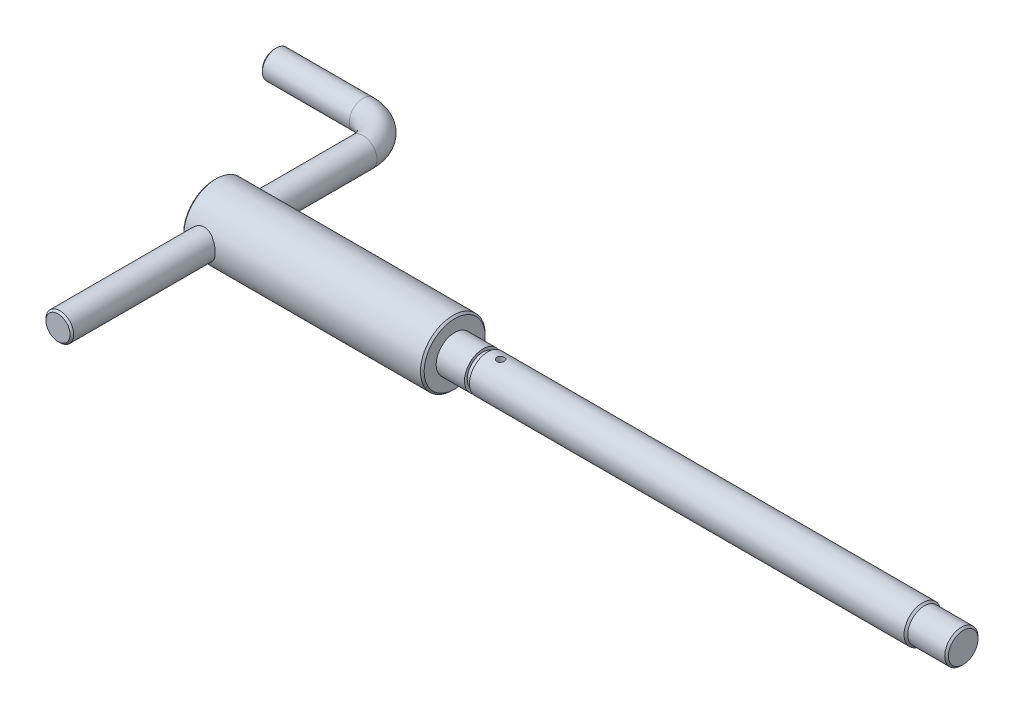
ISO-10303-21;
HEADER;
FILE_DESCRIPTION(('STEP AP214'),'2;1');
FILE_NAME('part.step','',(''),(''),'','','');
FILE_SCHEMA(('AUTOMOTIVE_DESIGN { 1 0 10303 214 1 1 1 1 }'));
ENDSEC;
DATA;
#1=APPLICATION_CONTEXT('core data for automotive mechanical design processes');
#2=APPLICATION_PROTOCOL_DEFINITION('international standard','automotive_design',2000,#1);
#3=PRODUCT_CONTEXT('',#1,'mechanical');
#4=PRODUCT('Part','Part','',(#3));
#5=PRODUCT_RELATED_PRODUCT_CATEGORY('part','',(#4));
#6=PRODUCT_DEFINITION_FORMATION('','',#4);
#7=PRODUCT_DEFINITION_CONTEXT('part definition',#1,'design');
#8=PRODUCT_DEFINITION('design','',#6,#7);
#9=PRODUCT_DEFINITION_SHAPE('','',#8);
#10=(LENGTH_UNIT() NAMED_UNIT(*) SI_UNIT(.MILLI.,.METRE.));
#11=(NAMED_UNIT(*) PLANE_ANGLE_UNIT() SI_UNIT($,.RADIAN.));
#12=(NAMED_UNIT(*) SI_UNIT($,.STERADIAN.) SOLID_ANGLE_UNIT());
#13=UNCERTAINTY_MEASURE_WITH_UNIT(LENGTH_MEASURE(1.E-05),#10,'distance_accuracy_value','');
#14=(GEOMETRIC_REPRESENTATION_CONTEXT(3) GLOBAL_UNCERTAINTY_ASSIGNED_CONTEXT((#13)) GLOBAL_UNIT_ASSIGNED_CONTEXT((#10,
#11,#12)) REPRESENTATION_CONTEXT('',''));
#15=CARTESIAN_POINT('',(0.,0.,0.));
#16=DIRECTION('',(0.,0.,1.));
#17=DIRECTION('',(1.,0.,0.));
#18=AXIS2_PLACEMENT_3D('',#15,#16,#17);
#19=CARTESIAN_POINT('',(0.,0.,0.));
#20=DIRECTION('',(-1.,0.,0.));
#21=DIRECTION('',(0.,0.,1.));
#22=AXIS2_PLACEMENT_3D('',#19,#20,#21);
#23=CYLINDRICAL_SURFACE('',#22,10.);
#24=CARTESIAN_POINT('',(383.,0.,0.));
#25=DIRECTION('',(1.,0.,0.));
#26=DIRECTION('',(0.,0.,-1.));
#27=AXIS2_PLACEMENT_3D('',#24,#25,#26);
#28=CIRCLE('',#27,10.);
#29=CARTESIAN_POINT('',(383.,0.,-10.));
#30=VERTEX_POINT('',#29);
#31=EDGE_CURVE('E65',#30,#30,#28,.F.);
#32=ORIENTED_EDGE('',*,*,#31,.T.);
#33=EDGE_LOOP('',(#32));
#34=FACE_BOUND('',#33,.T.);
#35=CARTESIAN_POINT('',(148.,0.,0.));
#36=DIRECTION('',(-1.,0.,0.));
#37=DIRECTION('',(0.,0.,1.));
#38=AXIS2_PLACEMENT_3D('',#35,#36,#37);
#39=CIRCLE('',#38,10.);
#40=CARTESIAN_POINT('',(148.,0.,10.));
#41=VERTEX_POINT('',#40);
#42=EDGE_CURVE('E137',#41,#41,#39,.T.);
#43=ORIENTED_EDGE('',*,*,#42,.F.);
#44=EDGE_LOOP('',(#43));
#45=FACE_BOUND('',#44,.T.);
#46=CARTESIAN_POINT('',(154.91,-9.79795897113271,-2.));
#47=CARTESIAN_POINT('',(154.798871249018,-9.79796118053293,-1.99999589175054));
#48=CARTESIAN_POINT('',(154.687690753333,-9.79987016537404,-1.99070634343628));
#49=CARTESIAN_POINT('',(154.468474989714,-9.80728862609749,-1.95382456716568));
#50=CARTESIAN_POINT('',(154.360442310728,-9.81280098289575,-1.92621769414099));
#51=CARTESIAN_POINT('',(154.150725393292,-9.82677747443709,-1.85359156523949));
#52=CARTESIAN_POINT('',(154.049034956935,-9.83523867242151,-1.80858962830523));
#53=CARTESIAN_POINT('',(153.854650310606,-9.85415598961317,-1.702498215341));
#54=CARTESIAN_POINT('',(153.761955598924,-9.86461199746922,-1.64140963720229));
#55=CARTESIAN_POINT('',(153.586877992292,-9.88650599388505,-1.50395815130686));
#56=CARTESIAN_POINT('',(153.504640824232,-9.89795475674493,-1.42741131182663));
#57=CARTESIAN_POINT('',(153.354084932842,-9.92044944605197,-1.26161357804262));
#58=CARTESIAN_POINT('',(153.285767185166,-9.93149534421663,-1.17236179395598));
#59=CARTESIAN_POINT('',(153.164423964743,-9.95205592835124,-0.982722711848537));
#60=CARTESIAN_POINT('',(153.111536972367,-9.96155642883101,-0.882245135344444));
#61=CARTESIAN_POINT('',(153.023450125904,-9.97783473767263,-0.673608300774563));
#62=CARTESIAN_POINT('',(152.988248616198,-9.98461280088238,-0.565449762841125));
#63=CARTESIAN_POINT('',(152.936985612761,-9.99460641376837,-0.346033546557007));
#64=CARTESIAN_POINT('',(152.920678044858,-9.99786772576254,-0.234835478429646));
#65=CARTESIAN_POINT('',(152.906898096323,-10.0006184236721,-0.0112371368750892));
#66=CARTESIAN_POINT('',(152.909423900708,-10.0001081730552,0.101163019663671));
#67=CARTESIAN_POINT('',(152.933052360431,-9.99540869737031,0.322284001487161));
#68=CARTESIAN_POINT('',(152.953889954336,-9.99127196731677,0.431034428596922));
#69=CARTESIAN_POINT('',(153.013130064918,-9.97984354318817,0.643463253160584));
#70=CARTESIAN_POINT('',(153.051533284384,-9.97255172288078,0.747141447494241));
#71=CARTESIAN_POINT('',(153.145060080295,-9.95554592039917,0.947238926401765));
#72=CARTESIAN_POINT('',(153.20028750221,-9.94581696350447,1.04360834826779));
#73=CARTESIAN_POINT('',(153.325818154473,-9.92500938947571,1.22581009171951));
#74=CARTESIAN_POINT('',(153.396123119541,-9.91393061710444,1.31164119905));
#75=CARTESIAN_POINT('',(153.551267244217,-9.89141928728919,1.47190286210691));
#76=CARTESIAN_POINT('',(153.636338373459,-9.87998392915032,1.54610863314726));
#77=CARTESIAN_POINT('',(153.817832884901,-9.85823143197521,1.67923698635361));
#78=CARTESIAN_POINT('',(153.914256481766,-9.84791431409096,1.7381592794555));
#79=CARTESIAN_POINT('',(154.116041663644,-9.82956094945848,1.83912562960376));
#80=CARTESIAN_POINT('',(154.221421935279,-9.82152963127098,1.88113329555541));
#81=CARTESIAN_POINT('',(154.437942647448,-9.80872952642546,1.94678068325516));
#82=CARTESIAN_POINT('',(154.549082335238,-9.80396031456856,1.97042279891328));
#83=CARTESIAN_POINT('',(154.771929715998,-9.79830958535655,1.9983320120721));
#84=CARTESIAN_POINT('',(154.883595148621,-9.79736294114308,2.00292371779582));
#85=CARTESIAN_POINT('',(155.106096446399,-9.79928971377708,1.99347525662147));
#86=CARTESIAN_POINT('',(155.216932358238,-9.80216291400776,1.97943614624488));
#87=CARTESIAN_POINT('',(155.433537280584,-9.81134464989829,1.93340441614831));
#88=CARTESIAN_POINT('',(155.539344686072,-9.81761998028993,1.90158524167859));
#89=CARTESIAN_POINT('',(155.744126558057,-9.83286978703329,1.82108207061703));
#90=CARTESIAN_POINT('',(155.843100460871,-9.84184448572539,1.77239668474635));
#91=CARTESIAN_POINT('',(156.0328262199,-9.86162811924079,1.6588082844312));
#92=CARTESIAN_POINT('',(156.123454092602,-9.87245943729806,1.59370215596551));
#93=CARTESIAN_POINT('',(156.292616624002,-9.89467447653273,1.44939114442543));
#94=CARTESIAN_POINT('',(156.371150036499,-9.90605825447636,1.37018481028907));
#95=CARTESIAN_POINT('',(156.515125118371,-9.92830691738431,1.19846454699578));
#96=CARTESIAN_POINT('',(156.5803473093,-9.93916115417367,1.10576499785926));
#97=CARTESIAN_POINT('',(156.694291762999,-9.9589425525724,0.910535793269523));
#98=CARTESIAN_POINT('',(156.74301471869,-9.96786979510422,0.808006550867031));
#99=CARTESIAN_POINT('',(156.822257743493,-9.98274588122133,0.596605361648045));
#100=CARTESIAN_POINT('',(156.852881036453,-9.98871158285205,0.487773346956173));
#101=CARTESIAN_POINT('',(156.895382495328,-9.99706471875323,0.266378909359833));
#102=CARTESIAN_POINT('',(156.907262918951,-9.99945258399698,0.15381693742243));
#103=CARTESIAN_POINT('',(156.911853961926,-10.0003708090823,-0.0697457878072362));
#104=CARTESIAN_POINT('',(156.904894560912,-9.99896757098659,-0.180739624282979));
#105=CARTESIAN_POINT('',(156.872732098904,-9.99260087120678,-0.399942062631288));
#106=CARTESIAN_POINT('',(156.847529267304,-9.98763745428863,-0.508150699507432));
#107=CARTESIAN_POINT('',(156.779742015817,-9.97470996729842,-0.718505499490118));
#108=CARTESIAN_POINT('',(156.737197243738,-9.9667527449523,-0.82066488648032));
#109=CARTESIAN_POINT('',(156.635975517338,-9.9486944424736,-1.01644244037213));
#110=CARTESIAN_POINT('',(156.577297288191,-9.93859319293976,-1.11005993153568));
#111=CARTESIAN_POINT('',(156.444361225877,-9.91715198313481,-1.28772778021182));
#112=CARTESIAN_POINT('',(156.369867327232,-9.90579466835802,-1.37159943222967));
#113=CARTESIAN_POINT('',(156.207899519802,-9.8832244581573,-1.52576523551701));
#114=CARTESIAN_POINT('',(156.12042254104,-9.87201159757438,-1.59605616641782));
#115=CARTESIAN_POINT('',(155.933841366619,-9.85086685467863,-1.72178443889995));
#116=CARTESIAN_POINT('',(155.834622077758,-9.84095007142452,-1.77705362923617));
#117=CARTESIAN_POINT('',(155.62813445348,-9.82370474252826,-1.87004809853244));
#118=CARTESIAN_POINT('',(155.520873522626,-9.81637385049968,-1.90778929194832));
#119=CARTESIAN_POINT('',(155.329475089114,-9.8065936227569,-1.95733827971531));
#120=CARTESIAN_POINT('',(155.246429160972,-9.80337569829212,-1.97330779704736));
#121=CARTESIAN_POINT('',(155.078932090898,-9.79905756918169,-1.99464003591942));
#122=CARTESIAN_POINT('',(154.994480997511,-9.79795729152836,-2.00000312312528));
#123=CARTESIAN_POINT('',(154.91,-9.79795897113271,-2.));
#124=B_SPLINE_CURVE_WITH_KNOTS('',3,(#46,#47,#48,#49,#50,#51,#52,#53,#54,#55,#56,#57,#58,#59,
#60,#61,#62,#63,#64,#65,#66,#67,#68,#69,#70,#71,#72,#73,#74,#75,#76,#77,#78,#79,#80,#81,#82,#83,
#84,#85,#86,#87,#88,#89,#90,#91,#92,#93,#94,#95,#96,#97,#98,#99,#100,#101,#102,#103,#104,#105,
#106,#107,#108,#109,#110,#111,#112,#113,#114,#115,#116,#117,#118,#119,#120,#121,#122,#123),
.UNSPECIFIED.,.T.,.F.,(4,2,2,2,2,2,2,2,2,2,2,2,2,2,2,2,2,2,2,2,2,2,2,2,2,2,2,2,2,2,2,2,2,2,2,2,
2,2,4),(0.,0.333076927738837,0.666420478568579,0.999432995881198,1.33242692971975,
1.66964505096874,2.0068868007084,2.34706800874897,2.68721736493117,3.02288497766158,
3.35852024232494,3.68937579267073,4.02024458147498,4.35319848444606,4.68619071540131,
5.02498693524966,5.36378956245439,5.7033172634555,6.04280070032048,6.37647515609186,
6.71013069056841,7.04058683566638,7.37107020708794,7.7058611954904,8.04068665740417,
8.380652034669,8.72060313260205,9.05859627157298,9.39654869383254,9.7286203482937,
10.0606878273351,10.392000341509,10.7233390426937,11.0600230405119,11.3967867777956,
11.7371779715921,12.0772595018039,12.3304760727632,12.5836839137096),.UNSPECIFIED.);
#125=CARTESIAN_POINT('',(154.91,-9.79795897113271,-2.));
#126=VERTEX_POINT('',#125);
#127=EDGE_CURVE('E89',#126,#126,#124,.T.);
#128=ORIENTED_EDGE('',*,*,#127,.T.);
#129=EDGE_LOOP('',(#128));
#130=FACE_BOUND('',#129,.T.);
#131=CARTESIAN_POINT('',(154.91,9.79795897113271,-2.));
#132=CARTESIAN_POINT('',(155.021128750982,9.79796118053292,-1.99999589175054));
#133=CARTESIAN_POINT('',(155.132309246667,9.79987016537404,-1.99070634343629));
#134=CARTESIAN_POINT('',(155.351525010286,9.80728862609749,-1.95382456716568));
#135=CARTESIAN_POINT('',(155.459557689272,9.81280098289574,-1.92621769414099));
#136=CARTESIAN_POINT('',(155.669274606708,9.82677747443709,-1.85359156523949));
#137=CARTESIAN_POINT('',(155.770965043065,9.83523867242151,-1.80858962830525));
#138=CARTESIAN_POINT('',(155.965349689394,9.85415598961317,-1.70249821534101));
#139=CARTESIAN_POINT('',(156.058044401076,9.86461199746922,-1.6414096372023));
#140=CARTESIAN_POINT('',(156.233122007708,9.88650599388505,-1.50395815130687));
#141=CARTESIAN_POINT('',(156.315359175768,9.89795475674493,-1.42741131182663));
#142=CARTESIAN_POINT('',(156.465915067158,9.92044944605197,-1.26161357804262));
#143=CARTESIAN_POINT('',(156.534232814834,9.93149534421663,-1.17236179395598));
#144=CARTESIAN_POINT('',(156.655576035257,9.95205592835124,-0.982722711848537));
#145=CARTESIAN_POINT('',(156.708463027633,9.96155642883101,-0.882245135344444));
#146=CARTESIAN_POINT('',(156.796549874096,9.97783473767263,-0.673608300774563));
#147=CARTESIAN_POINT('',(156.831751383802,9.98461280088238,-0.565449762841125));
#148=CARTESIAN_POINT('',(156.883014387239,9.99460641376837,-0.346033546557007));
#149=CARTESIAN_POINT('',(156.899321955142,9.99786772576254,-0.234835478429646));
#150=CARTESIAN_POINT('',(156.913101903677,10.0006184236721,-0.0112371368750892));
#151=CARTESIAN_POINT('',(156.910576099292,10.0001081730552,0.101163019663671));
#152=CARTESIAN_POINT('',(156.886947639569,9.99540869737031,0.322284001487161));
#153=CARTESIAN_POINT('',(156.866110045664,9.99127196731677,0.431034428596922));
#154=CARTESIAN_POINT('',(156.806869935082,9.97984354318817,0.643463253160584));
#155=CARTESIAN_POINT('',(156.768466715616,9.97255172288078,0.747141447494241));
#156=CARTESIAN_POINT('',(156.674939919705,9.95554592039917,0.947238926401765));
#157=CARTESIAN_POINT('',(156.61971249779,9.94581696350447,1.04360834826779));
#158=CARTESIAN_POINT('',(156.494181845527,9.92500938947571,1.22581009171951));
#159=CARTESIAN_POINT('',(156.423876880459,9.91393061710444,1.31164119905));
#160=CARTESIAN_POINT('',(156.268732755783,9.89141928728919,1.47190286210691));
#161=CARTESIAN_POINT('',(156.183661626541,9.87998392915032,1.54610863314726));
#162=CARTESIAN_POINT('',(156.002167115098,9.85823143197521,1.67923698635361));
#163=CARTESIAN_POINT('',(155.905743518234,9.84791431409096,1.7381592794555));
#164=CARTESIAN_POINT('',(155.703958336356,9.82956094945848,1.83912562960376));
#165=CARTESIAN_POINT('',(155.598578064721,9.82152963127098,1.88113329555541));
#166=CARTESIAN_POINT('',(155.382057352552,9.80872952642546,1.94678068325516));
#167=CARTESIAN_POINT('',(155.270917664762,9.80396031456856,1.97042279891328));
#168=CARTESIAN_POINT('',(155.048070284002,9.79830958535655,1.9983320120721));
#169=CARTESIAN_POINT('',(154.936404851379,9.79736294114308,2.00292371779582));
#170=CARTESIAN_POINT('',(154.713903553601,9.79928971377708,1.99347525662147));
#171=CARTESIAN_POINT('',(154.603067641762,9.80216291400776,1.97943614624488));
#172=CARTESIAN_POINT('',(154.386462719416,9.81134464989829,1.93340441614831));
#173=CARTESIAN_POINT('',(154.280655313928,9.81761998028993,1.90158524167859));
#174=CARTESIAN_POINT('',(154.075873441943,9.83286978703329,1.82108207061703));
#175=CARTESIAN_POINT('',(153.976899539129,9.84184448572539,1.77239668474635));
#176=CARTESIAN_POINT('',(153.7871737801,9.86162811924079,1.6588082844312));
#177=CARTESIAN_POINT('',(153.696545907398,9.87245943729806,1.59370215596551));
#178=CARTESIAN_POINT('',(153.527383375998,9.89467447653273,1.44939114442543));
#179=CARTESIAN_POINT('',(153.448849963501,9.90605825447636,1.37018481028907));
#180=CARTESIAN_POINT('',(153.304874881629,9.92830691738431,1.19846454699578));
#181=CARTESIAN_POINT('',(153.2396526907,9.93916115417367,1.10576499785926));
#182=CARTESIAN_POINT('',(153.125708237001,9.9589425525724,0.910535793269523));
#183=CARTESIAN_POINT('',(153.07698528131,9.96786979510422,0.808006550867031));
#184=CARTESIAN_POINT('',(152.997742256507,9.98274588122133,0.596605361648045));
#185=CARTESIAN_POINT('',(152.967118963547,9.98871158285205,0.487773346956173));
#186=CARTESIAN_POINT('',(152.924617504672,9.99706471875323,0.266378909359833));
#187=CARTESIAN_POINT('',(152.912737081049,9.99945258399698,0.15381693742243));
#188=CARTESIAN_POINT('',(152.908146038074,10.0003708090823,-0.0697457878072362));
#189=CARTESIAN_POINT('',(152.915105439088,9.99896757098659,-0.180739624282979));
#190=CARTESIAN_POINT('',(152.947267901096,9.99260087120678,-0.399942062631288));
#191=CARTESIAN_POINT('',(152.972470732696,9.98763745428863,-0.508150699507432));
#192=CARTESIAN_POINT('',(153.040257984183,9.97470996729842,-0.718505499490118));
#193=CARTESIAN_POINT('',(153.082802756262,9.9667527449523,-0.82066488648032));
#194=CARTESIAN_POINT('',(153.184024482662,9.9486944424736,-1.01644244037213));
#195=CARTESIAN_POINT('',(153.242702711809,9.93859319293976,-1.11005993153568));
#196=CARTESIAN_POINT('',(153.375638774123,9.91715198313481,-1.28772778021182));
#197=CARTESIAN_POINT('',(153.450132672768,9.90579466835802,-1.37159943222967));
#198=CARTESIAN_POINT('',(153.612100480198,9.8832244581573,-1.52576523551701));
#199=CARTESIAN_POINT('',(153.69957745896,9.87201159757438,-1.59605616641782));
#200=CARTESIAN_POINT('',(153.886158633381,9.85086685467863,-1.72178443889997));
#201=CARTESIAN_POINT('',(153.985377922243,9.84095007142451,-1.77705362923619));
#202=CARTESIAN_POINT('',(154.19186554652,9.82370474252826,-1.87004809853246));
#203=CARTESIAN_POINT('',(154.299126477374,9.81637385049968,-1.90778929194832));
#204=CARTESIAN_POINT('',(154.490524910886,9.8065936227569,-1.95733827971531));
#205=CARTESIAN_POINT('',(154.573570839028,9.80337569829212,-1.97330779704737));
#206=CARTESIAN_POINT('',(154.741067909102,9.79905756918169,-1.99464003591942));
#207=CARTESIAN_POINT('',(154.825519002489,9.79795729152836,-2.00000312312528));
#208=CARTESIAN_POINT('',(154.91,9.79795897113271,-2.));
#209=B_SPLINE_CURVE_WITH_KNOTS('',3,(#131,#132,#133,#134,#135,#136,#137,#138,#139,#140,#141,
#142,#143,#144,#145,#146,#147,#148,#149,#150,#151,#152,#153,#154,#155,#156,#157,#158,#159,#160,
#161,#162,#163,#164,#165,#166,#167,#168,#169,#170,#171,#172,#173,#174,#175,#176,#177,#178,#179,
#180,#181,#182,#183,#184,#185,#186,#187,#188,#189,#190,#191,#192,#193,#194,#195,#196,#197,#198,
#199,#200,#201,#202,#203,#204,#205,#206,#207,#208),.UNSPECIFIED.,.T.,.F.,(4,2,2,2,2,2,2,2,2,2,2,
2,2,2,2,2,2,2,2,2,2,2,2,2,2,2,2,2,2,2,2,2,2,2,2,2,2,2,4),(0.,0.333076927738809,
0.666420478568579,0.999432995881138,1.33242692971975,1.66964505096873,2.0068868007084,
2.34706800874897,2.68721736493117,3.02288497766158,3.35852024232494,3.68937579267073,
4.02024458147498,4.35319848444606,4.68619071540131,5.02498693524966,5.36378956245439,
5.7033172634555,6.04280070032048,6.37647515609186,6.71013069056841,7.04058683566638,
7.37107020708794,7.7058611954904,8.04068665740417,8.380652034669,8.72060313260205,
9.05859627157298,9.39654869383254,9.7286203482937,10.0606878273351,10.392000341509,
10.7233390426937,11.0600230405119,11.3967867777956,11.7371779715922,12.0772595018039,
12.3304760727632,12.5836839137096),.UNSPECIFIED.);
#210=CARTESIAN_POINT('',(154.91,9.79795897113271,-2.));
#211=VERTEX_POINT('',#210);
#212=EDGE_CURVE('E132',#211,#211,#209,.T.);
#213=ORIENTED_EDGE('',*,*,#212,.T.);
#214=EDGE_LOOP('',(#213));
#215=FACE_BOUND('',#214,.T.);
#216=ADVANCED_FACE('F39',(#34,#45,#130,#215),#23,.T.);
#217=CARTESIAN_POINT('',(0.,0.,0.));
#218=DIRECTION('',(1.,0.,0.));
#219=DIRECTION('',(0.,0.,-1.));
#220=AXIS2_PLACEMENT_3D('',#217,#218,#219);
#221=PLANE('',#220);
#222=CARTESIAN_POINT('',(0.,0.,0.));
#223=DIRECTION('',(1.,0.,0.));
#224=DIRECTION('',(0.,0.,-1.));
#225=AXIS2_PLACEMENT_3D('',#222,#223,#224);
#226=CIRCLE('',#225,16.5000000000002);
#227=CARTESIAN_POINT('',(0.,0.,-16.5000000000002));
#228=VERTEX_POINT('',#227);
#229=EDGE_CURVE('E54',#228,#228,#226,.F.);
#230=ORIENTED_EDGE('',*,*,#229,.T.);
#231=EDGE_LOOP('',(#230));
#232=FACE_BOUND('',#231,.T.);
#233=ADVANCED_FACE('F141',(#232),#221,.F.);
#234=CARTESIAN_POINT('',(0.,0.,0.));
#235=DIRECTION('',(-1.,0.,0.));
#236=DIRECTION('',(0.,0.,1.));
#237=AXIS2_PLACEMENT_3D('',#234,#235,#236);
#238=CYLINDRICAL_SURFACE('',#237,17.5);
#239=CARTESIAN_POINT('',(0.999999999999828,0.,0.));
#240=DIRECTION('',(1.,0.,0.));
#241=DIRECTION('',(0.,0.,-1.));
#242=AXIS2_PLACEMENT_3D('',#239,#240,#241);
#243=CIRCLE('',#242,17.5);
#244=CARTESIAN_POINT('',(0.999999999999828,0.,-17.5));
#245=VERTEX_POINT('',#244);
#246=EDGE_CURVE('E46',#245,#245,#243,.T.);
#247=ORIENTED_EDGE('',*,*,#246,.T.);
#248=EDGE_LOOP('',(#247));
#249=FACE_BOUND('',#248,.T.);
#250=CARTESIAN_POINT('',(129.,0.,0.));
#251=DIRECTION('',(-1.,0.,0.));
#252=DIRECTION('',(0.,0.,1.));
#253=AXIS2_PLACEMENT_3D('',#250,#251,#252);
#254=CIRCLE('',#253,17.5);
#255=CARTESIAN_POINT('',(129.,0.,17.5));
#256=VERTEX_POINT('',#255);
#257=EDGE_CURVE('E50',#256,#256,#254,.T.);
#258=ORIENTED_EDGE('',*,*,#257,.T.);
#259=EDGE_LOOP('',(#258));
#260=FACE_BOUND('',#259,.T.);
#261=CARTESIAN_POINT('',(18.,0.,17.5));
#262=CARTESIAN_POINT('',(17.9999985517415,-0.200454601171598,17.4999988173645));
#263=CARTESIAN_POINT('',(17.9919528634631,-0.400969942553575,17.4965465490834));
#264=CARTESIAN_POINT('',(17.9598467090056,-0.800566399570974,17.4828232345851));
#265=CARTESIAN_POINT('',(17.9357765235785,-0.999646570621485,17.4725480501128));
#266=CARTESIAN_POINT('',(17.8718124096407,-1.39520418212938,17.4454228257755));
#267=CARTESIAN_POINT('',(17.8318872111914,-1.59167568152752,17.4285597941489));
#268=CARTESIAN_POINT('',(17.736610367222,-1.98028152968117,17.3886934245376));
#269=CARTESIAN_POINT('',(17.6812524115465,-2.17241406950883,17.3656875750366));
#270=CARTESIAN_POINT('',(17.5559021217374,-2.5502368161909,17.3142283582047));
#271=CARTESIAN_POINT('',(17.4859678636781,-2.73594927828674,17.2857966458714));
#272=CARTESIAN_POINT('',(17.3319246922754,-3.1006460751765,17.2241172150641));
#273=CARTESIAN_POINT('',(17.2478104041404,-3.27962782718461,17.1908676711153));
#274=CARTESIAN_POINT('',(17.0661613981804,-3.62965251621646,17.1203818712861));
#275=CARTESIAN_POINT('',(16.9686361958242,-3.8007009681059,17.0831484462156));
#276=CARTESIAN_POINT('',(16.7607792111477,-4.1341577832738,17.0055302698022));
#277=CARTESIAN_POINT('',(16.650442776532,-4.29656297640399,16.9651443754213));
#278=CARTESIAN_POINT('',(16.4121235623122,-4.61941038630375,16.8801725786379));
#279=CARTESIAN_POINT('',(16.2835493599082,-4.77938763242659,16.8354781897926));
#280=CARTESIAN_POINT('',(16.0139383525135,-5.08807259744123,16.7447723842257));
#281=CARTESIAN_POINT('',(15.8729010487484,-5.23677986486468,16.6987609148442));
#282=CARTESIAN_POINT('',(15.5790615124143,-5.5222386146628,16.6065467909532));
#283=CARTESIAN_POINT('',(15.4262511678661,-5.65898171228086,16.5603440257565));
#284=CARTESIAN_POINT('',(15.1098167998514,-5.9195936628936,16.4689852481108));
#285=CARTESIAN_POINT('',(14.946196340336,-6.04346672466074,16.4238288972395));
#286=CARTESIAN_POINT('',(14.5999430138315,-6.28388584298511,16.3334057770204));
#287=CARTESIAN_POINT('',(14.4167616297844,-6.39968967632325,16.2882613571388));
#288=CARTESIAN_POINT('',(14.040435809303,-6.61530960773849,16.2018878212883));
#289=CARTESIAN_POINT('',(13.8472955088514,-6.71513227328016,16.1606570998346));
#290=CARTESIAN_POINT('',(13.4522284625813,-6.89794958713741,16.0834741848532));
#291=CARTESIAN_POINT('',(13.2503034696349,-6.9809475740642,16.047520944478));
#292=CARTESIAN_POINT('',(12.8390377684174,-7.12928296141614,15.9821745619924));
#293=CARTESIAN_POINT('',(12.6296976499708,-7.19462176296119,15.9527808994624));
#294=CARTESIAN_POINT('',(12.2158464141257,-7.30406478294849,15.9029579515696));
#295=CARTESIAN_POINT('',(12.0116184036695,-7.34906848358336,15.882153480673));
#296=CARTESIAN_POINT('',(11.5994891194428,-7.42192056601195,15.8482401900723));
#297=CARTESIAN_POINT('',(11.3915879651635,-7.4497695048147,15.8351311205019));
#298=CARTESIAN_POINT('',(10.9739350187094,-7.48794608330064,15.8171145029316));
#299=CARTESIAN_POINT('',(10.7641842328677,-7.49828272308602,15.8122027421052));
#300=CARTESIAN_POINT('',(10.3445319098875,-7.50132329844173,15.810760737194));
#301=CARTESIAN_POINT('',(10.1346303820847,-7.49402824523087,15.8142300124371));
#302=CARTESIAN_POINT('',(9.73370675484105,-7.46323203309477,15.8287845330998));
#303=CARTESIAN_POINT('',(9.54255272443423,-7.44111418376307,15.8392194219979));
#304=CARTESIAN_POINT('',(9.16290660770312,-7.38234975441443,15.8666935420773));
#305=CARTESIAN_POINT('',(8.97441545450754,-7.34569820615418,15.8837350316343));
#306=CARTESIAN_POINT('',(8.60145754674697,-7.25825174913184,15.923884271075));
#307=CARTESIAN_POINT('',(8.41698989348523,-7.2074600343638,15.9469906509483));
#308=CARTESIAN_POINT('',(8.05308824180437,-7.0921835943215,15.9985910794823));
#309=CARTESIAN_POINT('',(7.87365621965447,-7.02769357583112,16.0270872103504));
#310=CARTESIAN_POINT('',(7.51711569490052,-6.88404883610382,16.0893170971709));
#311=CARTESIAN_POINT('',(7.34013924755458,-6.80460963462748,16.1231499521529));
#312=CARTESIAN_POINT('',(6.99343000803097,-6.63260366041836,16.194667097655));
#313=CARTESIAN_POINT('',(6.82369968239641,-6.5400324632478,16.2323526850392));
#314=CARTESIAN_POINT('',(6.49234298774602,-6.34238965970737,16.3105912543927));
#315=CARTESIAN_POINT('',(6.33071787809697,-6.2373161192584,16.3511446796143));
#316=CARTESIAN_POINT('',(6.01633918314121,-6.01529905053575,16.4341175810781));
#317=CARTESIAN_POINT('',(5.86358612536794,-5.89835481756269,16.4765371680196));
#318=CARTESIAN_POINT('',(5.55430244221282,-5.64215816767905,16.5661124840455));
#319=CARTESIAN_POINT('',(5.39867272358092,-5.50184507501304,16.6133504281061));
#320=CARTESIAN_POINT('',(5.09970028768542,-5.2087025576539,16.7075764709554));
#321=CARTESIAN_POINT('',(4.95635409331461,-5.05587669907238,16.7545646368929));
#322=CARTESIAN_POINT('',(4.68265988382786,-4.73840717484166,16.8471020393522));
#323=CARTESIAN_POINT('',(4.55232017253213,-4.57375607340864,16.8926503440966));
#324=CARTESIAN_POINT('',(4.30565329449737,-4.23369484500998,16.9810682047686));
#325=CARTESIAN_POINT('',(4.18932053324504,-4.05828905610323,17.0239388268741));
#326=CARTESIAN_POINT('',(3.96860624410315,-3.69291637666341,17.1069685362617));
#327=CARTESIAN_POINT('',(3.86461866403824,-3.50268810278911,17.1470268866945));
#328=CARTESIAN_POINT('',(3.67320928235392,-3.11319608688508,17.2220009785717));
#329=CARTESIAN_POINT('',(3.58578027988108,-2.9139363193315,17.2569189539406));
#330=CARTESIAN_POINT('',(3.42832320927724,-2.50775149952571,17.3206070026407));
#331=CARTESIAN_POINT('',(3.35829094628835,-2.30082830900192,17.349378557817));
#332=CARTESIAN_POINT('',(3.2363833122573,-1.88086874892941,17.3999151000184));
#333=CARTESIAN_POINT('',(3.18450647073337,-1.66783287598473,17.4216806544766));
#334=CARTESIAN_POINT('',(3.10234352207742,-1.2516579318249,17.4563464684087));
#335=CARTESIAN_POINT('',(3.0708562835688,-1.04879628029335,17.4697378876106));
#336=CARTESIAN_POINT('',(3.02460933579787,-0.640835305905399,17.4894546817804));
#337=CARTESIAN_POINT('',(3.00984889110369,-0.435736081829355,17.4957803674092));
#338=CARTESIAN_POINT('',(2.9972280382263,-0.0249783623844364,17.5011872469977));
#339=CARTESIAN_POINT('',(2.99936313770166,0.180679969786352,17.500270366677));
#340=CARTESIAN_POINT('',(3.02049787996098,0.590965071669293,17.4912223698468));
#341=CARTESIAN_POINT('',(3.0394971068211,0.795591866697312,17.4830914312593));
#342=CARTESIAN_POINT('',(3.09267624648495,1.19132790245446,17.4604668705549));
#343=CARTESIAN_POINT('',(3.12599064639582,1.38257514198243,17.4463364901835));
#344=CARTESIAN_POINT('',(3.20721172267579,1.76147435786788,17.4121625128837));
#345=CARTESIAN_POINT('',(3.25512346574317,1.9491250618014,17.3921168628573));
#346=CARTESIAN_POINT('',(3.3650695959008,2.31949912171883,17.3466057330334));
#347=CARTESIAN_POINT('',(3.42709979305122,2.50222392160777,17.3211418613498));
#348=CARTESIAN_POINT('',(3.56477871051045,2.86177944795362,17.2653796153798));
#349=CARTESIAN_POINT('',(3.64043262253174,3.03860789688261,17.2350793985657));
#350=CARTESIAN_POINT('',(3.80728294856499,3.39067058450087,17.1693448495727));
#351=CARTESIAN_POINT('',(3.89888673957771,3.56568747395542,17.1337809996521));
#352=CARTESIAN_POINT('',(4.09525842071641,3.90744706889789,17.0590875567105));
#353=CARTESIAN_POINT('',(4.2000308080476,4.07418692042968,17.0199567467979));
#354=CARTESIAN_POINT('',(4.42203285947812,4.39851584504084,16.939037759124));
#355=CARTESIAN_POINT('',(4.53926480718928,4.55610323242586,16.8972490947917));
#356=CARTESIAN_POINT('',(4.78546986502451,4.86133694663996,16.8119754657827));
#357=CARTESIAN_POINT('',(4.91444358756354,5.00898275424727,16.7684904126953));
#358=CARTESIAN_POINT('',(5.1936111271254,5.30439432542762,16.6775015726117));
#359=CARTESIAN_POINT('',(5.34467208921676,5.45132482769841,16.6299425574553));
#360=CARTESIAN_POINT('',(5.65864760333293,5.73198339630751,16.5353045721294));
#361=CARTESIAN_POINT('',(5.82155859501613,5.86571539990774,16.4882254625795));
#362=CARTESIAN_POINT('',(6.15849788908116,6.11930103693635,16.3958038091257));
#363=CARTESIAN_POINT('',(6.3325336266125,6.23914523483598,16.3504624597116));
#364=CARTESIAN_POINT('',(6.69059108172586,6.46398274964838,16.2628866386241));
#365=CARTESIAN_POINT('',(6.87460859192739,6.56898225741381,16.22065087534));
#366=CARTESIAN_POINT('',(7.25513605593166,6.76516963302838,16.1398249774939));
#367=CARTESIAN_POINT('',(7.45181426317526,6.85606566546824,16.1013168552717));
#368=CARTESIAN_POINT('',(7.85313438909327,7.02076358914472,16.0301880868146));
#369=CARTESIAN_POINT('',(8.05777256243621,7.09457340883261,15.9975647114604));
#370=CARTESIAN_POINT('',(8.4735172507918,7.22431723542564,15.9393946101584));
#371=CARTESIAN_POINT('',(8.68462047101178,7.28026018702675,15.9138443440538));
#372=CARTESIAN_POINT('',(9.11168643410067,7.37362498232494,15.870800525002));
#373=CARTESIAN_POINT('',(9.32764867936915,7.41104871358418,15.8533061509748));
#374=CARTESIAN_POINT('',(9.74503421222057,7.46462802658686,15.8281434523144));
#375=CARTESIAN_POINT('',(9.94622921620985,7.4822525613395,15.8197977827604));
#376=CARTESIAN_POINT('',(10.3495534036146,7.50120758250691,15.8108190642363));
#377=CARTESIAN_POINT('',(10.551682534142,7.50253898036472,15.8101855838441));
#378=CARTESIAN_POINT('',(10.9552294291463,7.48889324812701,15.8166536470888));
#379=CARTESIAN_POINT('',(11.1566473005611,7.4739186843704,15.8237539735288));
#380=CARTESIAN_POINT('',(11.5572188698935,7.42784841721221,15.8454319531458));
#381=CARTESIAN_POINT('',(11.7563725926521,7.39675289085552,15.8600095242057));
#382=CARTESIAN_POINT('',(12.1405737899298,7.32084921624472,15.8951820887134));
#383=CARTESIAN_POINT('',(12.3258136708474,7.27684482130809,15.915421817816));
#384=CARTESIAN_POINT('',(12.6918238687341,7.17509583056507,15.9615512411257));
#385=CARTESIAN_POINT('',(12.8725926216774,7.11734649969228,15.987442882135));
#386=CARTESIAN_POINT('',(13.2285278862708,6.98862987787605,16.0441263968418));
#387=CARTESIAN_POINT('',(13.4036952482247,6.9176646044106,16.0749175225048));
#388=CARTESIAN_POINT('',(13.747608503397,6.76303209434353,16.1405839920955));
#389=CARTESIAN_POINT('',(13.9163519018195,6.67935998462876,16.1754609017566));
#390=CARTESIAN_POINT('',(14.2567215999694,6.49436957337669,16.2506533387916));
#391=CARTESIAN_POINT('',(14.4278849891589,6.39228168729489,16.2911715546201));
#392=CARTESIAN_POINT('',(14.7611819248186,6.17510400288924,16.3747252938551));
#393=CARTESIAN_POINT('',(14.9233123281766,6.06000972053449,16.4177616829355));
#394=CARTESIAN_POINT('',(15.2377210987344,5.81750965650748,16.5052474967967));
#395=CARTESIAN_POINT('',(15.3899979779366,5.69010202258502,16.54969713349));
#396=CARTESIAN_POINT('',(15.6839327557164,5.42366959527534,16.6389165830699));
#397=CARTESIAN_POINT('',(15.825590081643,5.2846441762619,16.6836864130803));
#398=CARTESIAN_POINT('',(16.1083325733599,4.98422049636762,16.7759991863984));
#399=CARTESIAN_POINT('',(16.248483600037,4.82192235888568,16.8234808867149));
#400=CARTESIAN_POINT('',(16.5146012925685,4.48559255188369,16.9162607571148));
#401=CARTESIAN_POINT('',(16.6405726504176,4.31156479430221,16.9615596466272));
#402=CARTESIAN_POINT('',(16.8775769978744,3.95257033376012,17.048792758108));
#403=CARTESIAN_POINT('',(16.9885961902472,3.76759375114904,17.0907238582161));
#404=CARTESIAN_POINT('',(17.1945904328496,3.38807466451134,17.1699884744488));
#405=CARTESIAN_POINT('',(17.2895728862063,3.1935366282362,17.2073241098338));
#406=CARTESIAN_POINT('',(17.4614469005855,2.79891396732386,17.2758680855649));
#407=CARTESIAN_POINT('',(17.5385739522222,2.59894571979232,17.3071551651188));
#408=CARTESIAN_POINT('',(17.6756048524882,2.19241326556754,17.3633348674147));
#409=CARTESIAN_POINT('',(17.7355169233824,1.98585226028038,17.388230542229));
#410=CARTESIAN_POINT('',(17.8373668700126,1.56816774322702,17.4308582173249));
#411=CARTESIAN_POINT('',(17.8793485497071,1.35705668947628,17.4486076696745));
#412=CARTESIAN_POINT('',(17.9450221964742,0.931618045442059,17.4764831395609));
#413=CARTESIAN_POINT('',(17.9687272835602,0.717292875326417,17.4866146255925));
#414=CARTESIAN_POINT('',(17.9887709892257,0.418732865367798,17.4951900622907));
#415=CARTESIAN_POINT('',(17.9929805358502,0.33505589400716,17.4969926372));
#416=CARTESIAN_POINT('',(17.9985953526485,0.167589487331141,17.499397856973));
#417=CARTESIAN_POINT('',(18.0000006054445,0.0838000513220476,17.5000004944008));
#418=CARTESIAN_POINT('',(18.,0.,17.5));
#419=B_SPLINE_CURVE_WITH_KNOTS('',3,(#261,#262,#263,#264,#265,#266,#267,#268,#269,#270,#271,
#272,#273,#274,#275,#276,#277,#278,#279,#280,#281,#282,#283,#284,#285,#286,#287,#288,#289,#290,
#291,#292,#293,#294,#295,#296,#297,#298,#299,#300,#301,#302,#303,#304,#305,#306,#307,#308,#309,
#310,#311,#312,#313,#314,#315,#316,#317,#318,#319,#320,#321,#322,#323,#324,#325,#326,#327,#328,
#329,#330,#331,#332,#333,#334,#335,#336,#337,#338,#339,#340,#341,#342,#343,#344,#345,#346,#347,
#348,#349,#350,#351,#352,#353,#354,#355,#356,#357,#358,#359,#360,#361,#362,#363,#364,#365,#366,
#367,#368,#369,#370,#371,#372,#373,#374,#375,#376,#377,#378,#379,#380,#381,#382,#383,#384,#385,
#386,#387,#388,#389,#390,#391,#392,#393,#394,#395,#396,#397,#398,#399,#400,#401,#402,#403,#404,
#405,#406,#407,#408,#409,#410,#411,#412,#413,#414,#415,#416,#417,#418),.UNSPECIFIED.,.T.,.F.,(4,
2,2,2,2,2,2,2,2,2,2,2,2,2,2,2,2,2,2,2,2,2,2,2,2,2,2,2,2,2,2,2,2,2,2,2,2,2,2,2,2,2,2,2,2,2,2,2,2,
2,2,2,2,2,2,2,2,2,2,2,2,2,2,2,2,2,2,2,2,2,2,2,2,2,2,2,2,2,4),(0.,0.601279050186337,
1.20292312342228,1.80575972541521,2.40884317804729,3.00956820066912,3.61052143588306,
4.21105045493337,4.81179823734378,5.44126418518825,6.07075533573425,6.70068417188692,
7.33040635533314,7.99368610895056,8.65669258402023,9.31956736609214,9.98238953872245,
10.612020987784,11.2416319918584,11.8709193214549,12.5001705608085,13.0776295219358,
13.6552860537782,14.2328122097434,14.8105619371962,15.4006847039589,15.9910067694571,
16.5814202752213,17.171868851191,17.8155470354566,18.4590424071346,19.1029460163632,
19.7465915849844,20.4071352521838,21.0673910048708,21.7274873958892,22.3875303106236,
23.0039155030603,23.6202735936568,24.2364678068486,24.8526468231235,25.4358972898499,
26.0193504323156,26.6026306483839,27.1861336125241,27.787631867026,28.3893361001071,
28.9911508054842,29.5929969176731,30.2403556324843,30.887520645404,31.5351228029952,
32.1824540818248,32.8417750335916,33.5007894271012,34.1594733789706,34.8180901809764,
35.4237150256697,36.0293059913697,36.634801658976,37.2402906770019,37.8140580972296,
38.3880234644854,38.961901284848,39.5359997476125,40.1454687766,40.7551485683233,
41.3649202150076,41.9747247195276,42.6328325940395,43.2907220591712,43.9492144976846,
44.6074021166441,45.2563394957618,45.9049664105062,46.5519995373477,47.1985677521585,
47.4499309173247,47.7012956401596),.UNSPECIFIED.);
#420=CARTESIAN_POINT('',(18.,0.,17.5));
#421=VERTEX_POINT('',#420);
#422=EDGE_CURVE('E81',#421,#421,#419,.T.);
#423=ORIENTED_EDGE('',*,*,#422,.T.);
#424=EDGE_LOOP('',(#423));
#425=FACE_BOUND('',#424,.T.);
#426=CARTESIAN_POINT('',(18.,0.,-17.5));
#427=CARTESIAN_POINT('',(17.9999985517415,0.200454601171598,-17.4999988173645));
#428=CARTESIAN_POINT('',(17.9919528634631,0.400969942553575,-17.4965465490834));
#429=CARTESIAN_POINT('',(17.9598467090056,0.800566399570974,-17.4828232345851));
#430=CARTESIAN_POINT('',(17.9357765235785,0.999646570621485,-17.4725480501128));
#431=CARTESIAN_POINT('',(17.8718124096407,1.39520418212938,-17.4454228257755));
#432=CARTESIAN_POINT('',(17.8318872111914,1.59167568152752,-17.4285597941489));
#433=CARTESIAN_POINT('',(17.736610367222,1.98028152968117,-17.3886934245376));
#434=CARTESIAN_POINT('',(17.6812524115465,2.17241406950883,-17.3656875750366));
#435=CARTESIAN_POINT('',(17.5559021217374,2.5502368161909,-17.3142283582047));
#436=CARTESIAN_POINT('',(17.4859678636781,2.73594927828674,-17.2857966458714));
#437=CARTESIAN_POINT('',(17.3319246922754,3.1006460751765,-17.2241172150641));
#438=CARTESIAN_POINT('',(17.2478104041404,3.27962782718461,-17.1908676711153));
#439=CARTESIAN_POINT('',(17.0661613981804,3.62965251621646,-17.1203818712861));
#440=CARTESIAN_POINT('',(16.9686361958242,3.8007009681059,-17.0831484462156));
#441=CARTESIAN_POINT('',(16.7607792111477,4.1341577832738,-17.0055302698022));
#442=CARTESIAN_POINT('',(16.650442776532,4.29656297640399,-16.9651443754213));
#443=CARTESIAN_POINT('',(16.4121235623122,4.61941038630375,-16.8801725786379));
#444=CARTESIAN_POINT('',(16.2835493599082,4.77938763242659,-16.8354781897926));
#445=CARTESIAN_POINT('',(16.0139383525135,5.08807259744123,-16.7447723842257));
#446=CARTESIAN_POINT('',(15.8729010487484,5.23677986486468,-16.6987609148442));
#447=CARTESIAN_POINT('',(15.5790615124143,5.5222386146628,-16.6065467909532));
#448=CARTESIAN_POINT('',(15.4262511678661,5.65898171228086,-16.5603440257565));
#449=CARTESIAN_POINT('',(15.1098167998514,5.9195936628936,-16.4689852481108));
#450=CARTESIAN_POINT('',(14.946196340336,6.04346672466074,-16.4238288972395));
#451=CARTESIAN_POINT('',(14.5999430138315,6.28388584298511,-16.3334057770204));
#452=CARTESIAN_POINT('',(14.4167616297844,6.39968967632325,-16.2882613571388));
#453=CARTESIAN_POINT('',(14.040435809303,6.61530960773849,-16.2018878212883));
#454=CARTESIAN_POINT('',(13.8472955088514,6.71513227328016,-16.1606570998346));
#455=CARTESIAN_POINT('',(13.4522284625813,6.89794958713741,-16.0834741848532));
#456=CARTESIAN_POINT('',(13.2503034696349,6.9809475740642,-16.047520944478));
#457=CARTESIAN_POINT('',(12.8390377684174,7.12928296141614,-15.9821745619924));
#458=CARTESIAN_POINT('',(12.6296976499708,7.19462176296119,-15.9527808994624));
#459=CARTESIAN_POINT('',(12.2158464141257,7.30406478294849,-15.9029579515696));
#460=CARTESIAN_POINT('',(12.0116184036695,7.34906848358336,-15.882153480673));
#461=CARTESIAN_POINT('',(11.5994891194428,7.42192056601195,-15.8482401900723));
#462=CARTESIAN_POINT('',(11.3915879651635,7.4497695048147,-15.8351311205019));
#463=CARTESIAN_POINT('',(10.9739350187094,7.48794608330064,-15.8171145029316));
#464=CARTESIAN_POINT('',(10.7641842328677,7.49828272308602,-15.8122027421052));
#465=CARTESIAN_POINT('',(10.3445319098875,7.50132329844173,-15.810760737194));
#466=CARTESIAN_POINT('',(10.1346303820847,7.49402824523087,-15.8142300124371));
#467=CARTESIAN_POINT('',(9.73370675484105,7.46323203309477,-15.8287845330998));
#468=CARTESIAN_POINT('',(9.54255272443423,7.44111418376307,-15.8392194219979));
#469=CARTESIAN_POINT('',(9.16290660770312,7.38234975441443,-15.8666935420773));
#470=CARTESIAN_POINT('',(8.97441545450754,7.34569820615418,-15.8837350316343));
#471=CARTESIAN_POINT('',(8.60145754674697,7.25825174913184,-15.923884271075));
#472=CARTESIAN_POINT('',(8.41698989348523,7.2074600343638,-15.9469906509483));
#473=CARTESIAN_POINT('',(8.05308824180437,7.0921835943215,-15.9985910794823));
#474=CARTESIAN_POINT('',(7.87365621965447,7.02769357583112,-16.0270872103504));
#475=CARTESIAN_POINT('',(7.51711569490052,6.88404883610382,-16.0893170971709));
#476=CARTESIAN_POINT('',(7.34013924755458,6.80460963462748,-16.1231499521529));
#477=CARTESIAN_POINT('',(6.99343000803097,6.63260366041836,-16.194667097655));
#478=CARTESIAN_POINT('',(6.82369968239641,6.5400324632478,-16.2323526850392));
#479=CARTESIAN_POINT('',(6.49234298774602,6.34238965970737,-16.3105912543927));
#480=CARTESIAN_POINT('',(6.33071787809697,6.2373161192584,-16.3511446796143));
#481=CARTESIAN_POINT('',(6.01633918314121,6.01529905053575,-16.4341175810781));
#482=CARTESIAN_POINT('',(5.86358612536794,5.89835481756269,-16.4765371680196));
#483=CARTESIAN_POINT('',(5.55430244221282,5.64215816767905,-16.5661124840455));
#484=CARTESIAN_POINT('',(5.39867272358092,5.50184507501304,-16.6133504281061));
#485=CARTESIAN_POINT('',(5.09970028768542,5.2087025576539,-16.7075764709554));
#486=CARTESIAN_POINT('',(4.95635409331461,5.05587669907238,-16.7545646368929));
#487=CARTESIAN_POINT('',(4.68265988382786,4.73840717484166,-16.8471020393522));
#488=CARTESIAN_POINT('',(4.55232017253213,4.57375607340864,-16.8926503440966));
#489=CARTESIAN_POINT('',(4.30565329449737,4.23369484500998,-16.9810682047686));
#490=CARTESIAN_POINT('',(4.18932053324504,4.05828905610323,-17.0239388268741));
#491=CARTESIAN_POINT('',(3.96860624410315,3.69291637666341,-17.1069685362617));
#492=CARTESIAN_POINT('',(3.86461866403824,3.50268810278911,-17.1470268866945));
#493=CARTESIAN_POINT('',(3.67320928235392,3.11319608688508,-17.2220009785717));
#494=CARTESIAN_POINT('',(3.58578027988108,2.9139363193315,-17.2569189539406));
#495=CARTESIAN_POINT('',(3.42832320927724,2.50775149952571,-17.3206070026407));
#496=CARTESIAN_POINT('',(3.35829094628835,2.30082830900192,-17.349378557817));
#497=CARTESIAN_POINT('',(3.2363833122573,1.88086874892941,-17.3999151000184));
#498=CARTESIAN_POINT('',(3.18450647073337,1.66783287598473,-17.4216806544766));
#499=CARTESIAN_POINT('',(3.10234352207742,1.2516579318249,-17.4563464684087));
#500=CARTESIAN_POINT('',(3.0708562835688,1.04879628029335,-17.4697378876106));
#501=CARTESIAN_POINT('',(3.02460933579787,0.640835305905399,-17.4894546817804));
#502=CARTESIAN_POINT('',(3.00984889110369,0.435736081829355,-17.4957803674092));
#503=CARTESIAN_POINT('',(2.9972280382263,0.0249783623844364,-17.5011872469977));
#504=CARTESIAN_POINT('',(2.99936313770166,-0.180679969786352,-17.500270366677));
#505=CARTESIAN_POINT('',(3.02049787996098,-0.590965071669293,-17.4912223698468));
#506=CARTESIAN_POINT('',(3.0394971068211,-0.795591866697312,-17.4830914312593));
#507=CARTESIAN_POINT('',(3.09267624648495,-1.19132790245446,-17.4604668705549));
#508=CARTESIAN_POINT('',(3.12599064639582,-1.38257514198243,-17.4463364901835));
#509=CARTESIAN_POINT('',(3.20721172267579,-1.76147435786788,-17.4121625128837));
#510=CARTESIAN_POINT('',(3.25512346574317,-1.9491250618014,-17.3921168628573));
#511=CARTESIAN_POINT('',(3.3650695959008,-2.31949912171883,-17.3466057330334));
#512=CARTESIAN_POINT('',(3.42709979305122,-2.50222392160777,-17.3211418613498));
#513=CARTESIAN_POINT('',(3.56477871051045,-2.86177944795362,-17.2653796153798));
#514=CARTESIAN_POINT('',(3.64043262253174,-3.03860789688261,-17.2350793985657));
#515=CARTESIAN_POINT('',(3.80728294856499,-3.39067058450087,-17.1693448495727));
#516=CARTESIAN_POINT('',(3.89888673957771,-3.56568747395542,-17.1337809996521));
#517=CARTESIAN_POINT('',(4.09525842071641,-3.90744706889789,-17.0590875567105));
#518=CARTESIAN_POINT('',(4.2000308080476,-4.07418692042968,-17.0199567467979));
#519=CARTESIAN_POINT('',(4.42203285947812,-4.39851584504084,-16.939037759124));
#520=CARTESIAN_POINT('',(4.53926480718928,-4.55610323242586,-16.8972490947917));
#521=CARTESIAN_POINT('',(4.78546986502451,-4.86133694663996,-16.8119754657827));
#522=CARTESIAN_POINT('',(4.91444358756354,-5.00898275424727,-16.7684904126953));
#523=CARTESIAN_POINT('',(5.1936111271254,-5.30439432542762,-16.6775015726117));
#524=CARTESIAN_POINT('',(5.34467208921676,-5.45132482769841,-16.6299425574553));
#525=CARTESIAN_POINT('',(5.65864760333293,-5.73198339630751,-16.5353045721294));
#526=CARTESIAN_POINT('',(5.82155859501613,-5.86571539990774,-16.4882254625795));
#527=CARTESIAN_POINT('',(6.15849788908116,-6.11930103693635,-16.3958038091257));
#528=CARTESIAN_POINT('',(6.3325336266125,-6.23914523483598,-16.3504624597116));
#529=CARTESIAN_POINT('',(6.69059108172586,-6.46398274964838,-16.2628866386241));
#530=CARTESIAN_POINT('',(6.87460859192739,-6.56898225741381,-16.22065087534));
#531=CARTESIAN_POINT('',(7.25513605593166,-6.76516963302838,-16.1398249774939));
#532=CARTESIAN_POINT('',(7.45181426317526,-6.85606566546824,-16.1013168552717));
#533=CARTESIAN_POINT('',(7.85313438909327,-7.02076358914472,-16.0301880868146));
#534=CARTESIAN_POINT('',(8.05777256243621,-7.09457340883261,-15.9975647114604));
#535=CARTESIAN_POINT('',(8.4735172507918,-7.22431723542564,-15.9393946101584));
#536=CARTESIAN_POINT('',(8.68462047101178,-7.28026018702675,-15.9138443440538));
#537=CARTESIAN_POINT('',(9.11168643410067,-7.37362498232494,-15.870800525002));
#538=CARTESIAN_POINT('',(9.32764867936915,-7.41104871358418,-15.8533061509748));
#539=CARTESIAN_POINT('',(9.74503421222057,-7.46462802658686,-15.8281434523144));
#540=CARTESIAN_POINT('',(9.94622921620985,-7.4822525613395,-15.8197977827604));
#541=CARTESIAN_POINT('',(10.3495534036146,-7.50120758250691,-15.8108190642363));
#542=CARTESIAN_POINT('',(10.551682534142,-7.50253898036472,-15.8101855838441));
#543=CARTESIAN_POINT('',(10.9552294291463,-7.48889324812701,-15.8166536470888));
#544=CARTESIAN_POINT('',(11.1566473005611,-7.4739186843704,-15.8237539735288));
#545=CARTESIAN_POINT('',(11.5572188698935,-7.42784841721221,-15.8454319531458));
#546=CARTESIAN_POINT('',(11.7563725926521,-7.39675289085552,-15.8600095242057));
#547=CARTESIAN_POINT('',(12.1405737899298,-7.32084921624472,-15.8951820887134));
#548=CARTESIAN_POINT('',(12.3258136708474,-7.27684482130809,-15.915421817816));
#549=CARTESIAN_POINT('',(12.6918238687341,-7.17509583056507,-15.9615512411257));
#550=CARTESIAN_POINT('',(12.8725926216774,-7.11734649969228,-15.987442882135));
#551=CARTESIAN_POINT('',(13.2285278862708,-6.98862987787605,-16.0441263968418));
#552=CARTESIAN_POINT('',(13.4036952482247,-6.9176646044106,-16.0749175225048));
#553=CARTESIAN_POINT('',(13.747608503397,-6.76303209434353,-16.1405839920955));
#554=CARTESIAN_POINT('',(13.9163519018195,-6.67935998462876,-16.1754609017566));
#555=CARTESIAN_POINT('',(14.2567215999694,-6.49436957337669,-16.2506533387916));
#556=CARTESIAN_POINT('',(14.4278849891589,-6.39228168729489,-16.2911715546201));
#557=CARTESIAN_POINT('',(14.7611819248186,-6.17510400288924,-16.3747252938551));
#558=CARTESIAN_POINT('',(14.9233123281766,-6.06000972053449,-16.4177616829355));
#559=CARTESIAN_POINT('',(15.2377210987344,-5.81750965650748,-16.5052474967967));
#560=CARTESIAN_POINT('',(15.3899979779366,-5.69010202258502,-16.54969713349));
#561=CARTESIAN_POINT('',(15.6839327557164,-5.42366959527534,-16.6389165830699));
#562=CARTESIAN_POINT('',(15.825590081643,-5.2846441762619,-16.6836864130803));
#563=CARTESIAN_POINT('',(16.1083325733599,-4.98422049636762,-16.7759991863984));
#564=CARTESIAN_POINT('',(16.248483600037,-4.82192235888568,-16.8234808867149));
#565=CARTESIAN_POINT('',(16.5146012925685,-4.48559255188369,-16.9162607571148));
#566=CARTESIAN_POINT('',(16.6405726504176,-4.31156479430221,-16.9615596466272));
#567=CARTESIAN_POINT('',(16.8775769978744,-3.95257033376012,-17.048792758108));
#568=CARTESIAN_POINT('',(16.9885961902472,-3.76759375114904,-17.0907238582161));
#569=CARTESIAN_POINT('',(17.1945904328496,-3.38807466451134,-17.1699884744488));
#570=CARTESIAN_POINT('',(17.2895728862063,-3.1935366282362,-17.2073241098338));
#571=CARTESIAN_POINT('',(17.4614469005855,-2.79891396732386,-17.2758680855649));
#572=CARTESIAN_POINT('',(17.5385739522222,-2.59894571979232,-17.3071551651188));
#573=CARTESIAN_POINT('',(17.6756048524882,-2.19241326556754,-17.3633348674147));
#574=CARTESIAN_POINT('',(17.7355169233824,-1.98585226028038,-17.388230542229));
#575=CARTESIAN_POINT('',(17.8373668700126,-1.56816774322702,-17.4308582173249));
#576=CARTESIAN_POINT('',(17.8793485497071,-1.35705668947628,-17.4486076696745));
#577=CARTESIAN_POINT('',(17.9450221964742,-0.931618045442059,-17.4764831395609));
#578=CARTESIAN_POINT('',(17.9687272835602,-0.717292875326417,-17.4866146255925));
#579=CARTESIAN_POINT('',(17.9887709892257,-0.418732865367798,-17.4951900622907));
#580=CARTESIAN_POINT('',(17.9929805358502,-0.33505589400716,-17.4969926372));
#581=CARTESIAN_POINT('',(17.9985953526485,-0.167589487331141,-17.499397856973));
#582=CARTESIAN_POINT('',(18.0000006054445,-0.0838000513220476,-17.5000004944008));
#583=CARTESIAN_POINT('',(18.,0.,-17.5));
#584=B_SPLINE_CURVE_WITH_KNOTS('',3,(#426,#427,#428,#429,#430,#431,#432,#433,#434,#435,#436,
#437,#438,#439,#440,#441,#442,#443,#444,#445,#446,#447,#448,#449,#450,#451,#452,#453,#454,#455,
#456,#457,#458,#459,#460,#461,#462,#463,#464,#465,#466,#467,#468,#469,#470,#471,#472,#473,#474,
#475,#476,#477,#478,#479,#480,#481,#482,#483,#484,#485,#486,#487,#488,#489,#490,#491,#492,#493,
#494,#495,#496,#497,#498,#499,#500,#501,#502,#503,#504,#505,#506,#507,#508,#509,#510,#511,#512,
#513,#514,#515,#516,#517,#518,#519,#520,#521,#522,#523,#524,#525,#526,#527,#528,#529,#530,#531,
#532,#533,#534,#535,#536,#537,#538,#539,#540,#541,#542,#543,#544,#545,#546,#547,#548,#549,#550,
#551,#552,#553,#554,#555,#556,#557,#558,#559,#560,#561,#562,#563,#564,#565,#566,#567,#568,#569,
#570,#571,#572,#573,#574,#575,#576,#577,#578,#579,#580,#581,#582,#583),.UNSPECIFIED.,.T.,.F.,(4,
2,2,2,2,2,2,2,2,2,2,2,2,2,2,2,2,2,2,2,2,2,2,2,2,2,2,2,2,2,2,2,2,2,2,2,2,2,2,2,2,2,2,2,2,2,2,2,2,
2,2,2,2,2,2,2,2,2,2,2,2,2,2,2,2,2,2,2,2,2,2,2,2,2,2,2,2,2,4),(0.,0.601279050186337,
1.20292312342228,1.80575972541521,2.40884317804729,3.00956820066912,3.61052143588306,
4.21105045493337,4.81179823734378,5.44126418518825,6.07075533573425,6.70068417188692,
7.33040635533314,7.99368610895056,8.65669258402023,9.31956736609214,9.98238953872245,
10.612020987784,11.2416319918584,11.8709193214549,12.5001705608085,13.0776295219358,
13.6552860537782,14.2328122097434,14.8105619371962,15.4006847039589,15.9910067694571,
16.5814202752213,17.171868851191,17.8155470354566,18.4590424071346,19.1029460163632,
19.7465915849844,20.4071352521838,21.0673910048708,21.7274873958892,22.3875303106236,
23.0039155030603,23.6202735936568,24.2364678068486,24.8526468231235,25.4358972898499,
26.0193504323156,26.6026306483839,27.1861336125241,27.787631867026,28.3893361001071,
28.9911508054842,29.5929969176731,30.2403556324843,30.887520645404,31.5351228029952,
32.1824540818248,32.8417750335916,33.5007894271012,34.1594733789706,34.8180901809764,
35.4237150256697,36.0293059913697,36.634801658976,37.2402906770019,37.8140580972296,
38.3880234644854,38.961901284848,39.5359997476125,40.1454687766,40.7551485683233,
41.3649202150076,41.9747247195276,42.6328325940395,43.2907220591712,43.9492144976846,
44.6074021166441,45.2563394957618,45.9049664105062,46.5519995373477,47.1985677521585,
47.4499309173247,47.7012956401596),.UNSPECIFIED.);
#585=CARTESIAN_POINT('',(18.,0.,-17.5));
#586=VERTEX_POINT('',#585);
#587=EDGE_CURVE('E90',#586,#586,#584,.T.);
#588=ORIENTED_EDGE('',*,*,#587,.T.);
#589=EDGE_LOOP('',(#588));
#590=FACE_BOUND('',#589,.T.);
#591=ADVANCED_FACE('F95',(#249,#260,#425,#590),#238,.T.);
#592=CARTESIAN_POINT('',(130.,17.5,0.));
#593=DIRECTION('',(-1.,0.,0.));
#594=DIRECTION('',(0.,0.,1.));
#595=AXIS2_PLACEMENT_3D('',#592,#593,#594);
#596=PLANE('',#595);
#597=CARTESIAN_POINT('',(130.,0.,0.));
#598=DIRECTION('',(-1.,0.,0.));
#599=DIRECTION('',(0.,0.,1.));
#600=AXIS2_PLACEMENT_3D('',#597,#598,#599);
#601=CIRCLE('',#600,16.5000000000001);
#602=CARTESIAN_POINT('',(130.,0.,16.5000000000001));
#603=VERTEX_POINT('',#602);
#604=EDGE_CURVE('E10',#603,#603,#601,.F.);
#605=ORIENTED_EDGE('',*,*,#604,.T.);
#606=EDGE_LOOP('',(#605));
#607=FACE_BOUND('',#606,.T.);
#608=CARTESIAN_POINT('',(130.,0.,0.));
#609=DIRECTION('',(-1.,0.,0.));
#610=DIRECTION('',(0.,0.,1.));
#611=AXIS2_PLACEMENT_3D('',#608,#609,#610);
#612=CIRCLE('',#611,10.);
#613=CARTESIAN_POINT('',(130.,0.,10.));
#614=VERTEX_POINT('',#613);
#615=EDGE_CURVE('E80',#614,#614,#612,.T.);
#616=ORIENTED_EDGE('',*,*,#615,.T.);
#617=EDGE_LOOP('',(#616));
#618=FACE_BOUND('',#617,.T.);
#619=ADVANCED_FACE('F157',(#607,#618),#596,.F.);
#620=CARTESIAN_POINT('',(0.,0.,0.));
#621=DIRECTION('',(-1.,0.,0.));
#622=DIRECTION('',(0.,0.,1.));
#623=AXIS2_PLACEMENT_3D('',#620,#621,#622);
#624=CYLINDRICAL_SURFACE('',#623,10.);
#625=ORIENTED_EDGE('',*,*,#615,.F.);
#626=EDGE_LOOP('',(#625));
#627=FACE_BOUND('',#626,.T.);
#628=CARTESIAN_POINT('',(145.3,0.,0.));
#629=DIRECTION('',(-1.,0.,0.));
#630=DIRECTION('',(0.,0.,1.));
#631=AXIS2_PLACEMENT_3D('',#628,#629,#630);
#632=CIRCLE('',#631,10.);
#633=CARTESIAN_POINT('',(145.3,0.,10.));
#634=VERTEX_POINT('',#633);
#635=EDGE_CURVE('E166',#634,#634,#632,.T.);
#636=ORIENTED_EDGE('',*,*,#635,.T.);
#637=EDGE_LOOP('',(#636));
#638=FACE_BOUND('',#637,.T.);
#639=ADVANCED_FACE('F154',(#627,#638),#624,.T.);
#640=CARTESIAN_POINT('',(145.3,10.,0.));
#641=DIRECTION('',(-1.,0.,0.));
#642=DIRECTION('',(0.,0.,1.));
#643=AXIS2_PLACEMENT_3D('',#640,#641,#642);
#644=PLANE('',#643);
#645=ORIENTED_EDGE('',*,*,#635,.F.);
#646=EDGE_LOOP('',(#645));
#647=FACE_BOUND('',#646,.T.);
#648=CARTESIAN_POINT('',(145.3,0.,0.));
#649=DIRECTION('',(-1.,0.,0.));
#650=DIRECTION('',(0.,0.,1.));
#651=AXIS2_PLACEMENT_3D('',#648,#649,#650);
#652=CIRCLE('',#651,8.5);
#653=CARTESIAN_POINT('',(145.3,0.,8.5));
#654=VERTEX_POINT('',#653);
#655=EDGE_CURVE('E168',#654,#654,#652,.T.);
#656=ORIENTED_EDGE('',*,*,#655,.T.);
#657=EDGE_LOOP('',(#656));
#658=FACE_BOUND('',#657,.T.);
#659=ADVANCED_FACE('F150',(#647,#658),#644,.F.);
#660=CARTESIAN_POINT('',(0.,0.,0.));
#661=DIRECTION('',(-1.,0.,0.));
#662=DIRECTION('',(0.,0.,1.));
#663=AXIS2_PLACEMENT_3D('',#660,#661,#662);
#664=CYLINDRICAL_SURFACE('',#663,8.5);
#665=ORIENTED_EDGE('',*,*,#655,.F.);
#666=EDGE_LOOP('',(#665));
#667=FACE_BOUND('',#666,.T.);
#668=CARTESIAN_POINT('',(148.,0.,0.));
#669=DIRECTION('',(-1.,0.,0.));
#670=DIRECTION('',(0.,0.,1.));
#671=AXIS2_PLACEMENT_3D('',#668,#669,#670);
#672=CIRCLE('',#671,8.5);
#673=CARTESIAN_POINT('',(148.,0.,8.5));
#674=VERTEX_POINT('',#673);
#675=EDGE_CURVE('E173',#674,#674,#672,.T.);
#676=ORIENTED_EDGE('',*,*,#675,.T.);
#677=EDGE_LOOP('',(#676));
#678=FACE_BOUND('',#677,.T.);
#679=ADVANCED_FACE('F146',(#667,#678),#664,.T.);
#680=CARTESIAN_POINT('',(148.,8.5,0.));
#681=DIRECTION('',(1.,0.,0.));
#682=DIRECTION('',(0.,0.,-1.));
#683=AXIS2_PLACEMENT_3D('',#680,#681,#682);
#684=PLANE('',#683);
#685=ORIENTED_EDGE('',*,*,#675,.F.);
#686=EDGE_LOOP('',(#685));
#687=FACE_BOUND('',#686,.T.);
#688=ORIENTED_EDGE('',*,*,#42,.T.);
#689=EDGE_LOOP('',(#688));
#690=FACE_BOUND('',#689,.T.);
#691=ADVANCED_FACE('F122',(#687,#690),#684,.F.);
#692=CARTESIAN_POINT('',(154.91,17.5,0.));
#693=DIRECTION('',(0.,-1.,0.));
#694=DIRECTION('',(0.,0.,-1.));
#695=AXIS2_PLACEMENT_3D('',#692,#693,#694);
#696=CYLINDRICAL_SURFACE('',#695,2.);
#697=ORIENTED_EDGE('',*,*,#127,.F.);
#698=EDGE_LOOP('',(#697));
#699=FACE_BOUND('',#698,.T.);
#700=ORIENTED_EDGE('',*,*,#212,.F.);
#701=EDGE_LOOP('',(#700));
#702=FACE_BOUND('',#701,.T.);
#703=ADVANCED_FACE('F118',(#699,#702),#696,.F.);
#704=CARTESIAN_POINT('',(-55.,0.,-87.5));
#705=DIRECTION('',(1.,0.,0.));
#706=DIRECTION('',(0.,0.,-1.));
#707=AXIS2_PLACEMENT_3D('',#704,#705,#706);
#708=PLANE('',#707);
#709=CARTESIAN_POINT('',(-55.,0.,-87.5));
#710=DIRECTION('',(1.,0.,0.));
#711=DIRECTION('',(0.,0.,-1.));
#712=AXIS2_PLACEMENT_3D('',#709,#710,#711);
#713=CIRCLE('',#712,6.4999999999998);
#714=CARTESIAN_POINT('',(-55.,0.,-93.9999999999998));
#715=VERTEX_POINT('',#714);
#716=EDGE_CURVE('E68',#715,#715,#713,.F.);
#717=ORIENTED_EDGE('',*,*,#716,.T.);
#718=EDGE_LOOP('',(#717));
#719=FACE_BOUND('',#718,.T.);
#720=ADVANCED_FACE('F113',(#719),#708,.F.);
#721=CARTESIAN_POINT('',(-7.,0.,-70.));
#722=DIRECTION('',(0.,1.,0.));
#723=DIRECTION('',(0.,0.,1.));
#724=AXIS2_PLACEMENT_3D('',#721,#722,#723);
#725=TOROIDAL_SURFACE('',#724,17.5,7.5);
#726=CARTESIAN_POINT('',(10.5,0.,-70.));
#727=DIRECTION('',(0.,0.,1.));
#728=DIRECTION('',(1.,0.,0.));
#729=AXIS2_PLACEMENT_3D('',#726,#727,#728);
#730=CIRCLE('',#729,7.5);
#731=CARTESIAN_POINT('',(18.,0.,-70.));
#732=VERTEX_POINT('',#731);
#733=EDGE_CURVE('E181',#732,#732,#730,.T.);
#734=CARTESIAN_POINT('',(-6.99999999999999,0.,-87.5));
#735=DIRECTION('',(1.,0.,0.));
#736=DIRECTION('',(0.,0.,-1.));
#737=AXIS2_PLACEMENT_3D('',#734,#735,#736);
#738=CIRCLE('',#737,7.5);
#739=CARTESIAN_POINT('',(-6.99999999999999,0.,-95.));
#740=VERTEX_POINT('',#739);
#741=EDGE_CURVE('E178',#740,#740,#738,.T.);
#742=CARTESIAN_POINT('',(-7.,0.,-70.));
#743=DIRECTION('',(0.,1.,0.));
#744=DIRECTION('',(0.,0.,1.));
#745=AXIS2_PLACEMENT_3D('',#742,#743,#744);
#746=CIRCLE('',#745,25.);
#747=EDGE_CURVE('',#732,#740,#746,.T.);
#748=ORIENTED_EDGE('',*,*,#733,.F.);
#749=ORIENTED_EDGE('',*,*,#741,.T.);
#750=ORIENTED_EDGE('',*,*,#747,.T.);
#751=ORIENTED_EDGE('',*,*,#747,.F.);
#752=EDGE_LOOP('',(#748,#750,#749,#751));
#753=FACE_BOUND('',#752,.T.);
#754=ADVANCED_FACE('F108',(#753),#725,.T.);
#755=CARTESIAN_POINT('',(-6.99999999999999,0.,-87.5));
#756=DIRECTION('',(-1.,0.,0.));
#757=DIRECTION('',(0.,0.,1.));
#758=AXIS2_PLACEMENT_3D('',#755,#756,#757);
#759=CYLINDRICAL_SURFACE('',#758,7.5);
#760=CARTESIAN_POINT('',(-53.9999999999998,0.,-87.5));
#761=DIRECTION('',(1.,0.,0.));
#762=DIRECTION('',(0.,0.,-1.));
#763=AXIS2_PLACEMENT_3D('',#760,#761,#762);
#764=CIRCLE('',#763,7.5);
#765=CARTESIAN_POINT('',(-53.9999999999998,0.,-95.));
#766=VERTEX_POINT('',#765);
#767=EDGE_CURVE('E71',#766,#766,#764,.T.);
#768=ORIENTED_EDGE('',*,*,#767,.T.);
#769=EDGE_LOOP('',(#768));
#770=FACE_BOUND('',#769,.T.);
#771=ORIENTED_EDGE('',*,*,#741,.F.);
#772=EDGE_LOOP('',(#771));
#773=FACE_BOUND('',#772,.T.);
#774=ADVANCED_FACE('F112',(#770,#773),#759,.T.);
#775=CARTESIAN_POINT('',(10.5,0.,-70.));
#776=DIRECTION('',(0.,0.,1.));
#777=DIRECTION('',(1.,0.,0.));
#778=AXIS2_PLACEMENT_3D('',#775,#776,#777);
#779=CYLINDRICAL_SURFACE('',#778,7.5);
#780=ORIENTED_EDGE('',*,*,#733,.T.);
#781=EDGE_LOOP('',(#780));
#782=FACE_BOUND('',#781,.T.);
#783=ORIENTED_EDGE('',*,*,#587,.F.);
#784=EDGE_LOOP('',(#783));
#785=FACE_BOUND('',#784,.T.);
#786=ADVANCED_FACE('F105',(#782,#785),#779,.T.);
#787=CARTESIAN_POINT('',(10.5,0.,94.0000000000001));
#788=DIRECTION('',(0.,0.,1.));
#789=DIRECTION('',(1.,0.,0.));
#790=AXIS2_PLACEMENT_3D('',#787,#788,#789);
#791=CIRCLE('',#790,7.5);
#792=CARTESIAN_POINT('',(18.,0.,94.0000000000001));
#793=VERTEX_POINT('',#792);
#794=EDGE_CURVE('E74',#793,#793,#791,.F.);
#795=ORIENTED_EDGE('',*,*,#794,.T.);
#796=EDGE_LOOP('',(#795));
#797=FACE_BOUND('',#796,.T.);
#798=ORIENTED_EDGE('',*,*,#422,.F.);
#799=EDGE_LOOP('',(#798));
#800=FACE_BOUND('',#799,.T.);
#801=ADVANCED_FACE('F99',(#797,#800),#779,.T.);
#802=CARTESIAN_POINT('',(10.5,0.,95.));
#803=DIRECTION('',(0.,0.,1.));
#804=DIRECTION('',(1.,0.,0.));
#805=AXIS2_PLACEMENT_3D('',#802,#803,#804);
#806=PLANE('',#805);
#807=CARTESIAN_POINT('',(10.5,0.,95.));
#808=DIRECTION('',(0.,0.,1.));
#809=DIRECTION('',(1.,0.,0.));
#810=AXIS2_PLACEMENT_3D('',#807,#808,#809);
#811=CIRCLE('',#810,6.50000000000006);
#812=CARTESIAN_POINT('',(17.0000000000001,0.,95.));
#813=VERTEX_POINT('',#812);
#814=EDGE_CURVE('E77',#813,#813,#811,.T.);
#815=ORIENTED_EDGE('',*,*,#814,.T.);
#816=EDGE_LOOP('',(#815));
#817=FACE_BOUND('',#816,.T.);
#818=ADVANCED_FACE('F104',(#817),#806,.T.);
#819=CARTESIAN_POINT('',(10.5,0.,95.));
#820=DIRECTION('',(0.,0.,-1.));
#821=DIRECTION('',(-1.,0.,0.));
#822=AXIS2_PLACEMENT_3D('',#819,#820,#821);
#823=CONICAL_SURFACE('',#822,6.50000000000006,0.785398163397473);
#824=ORIENTED_EDGE('',*,*,#794,.F.);
#825=EDGE_LOOP('',(#824));
#826=FACE_BOUND('',#825,.T.);
#827=ORIENTED_EDGE('',*,*,#814,.F.);
#828=EDGE_LOOP('',(#827));
#829=FACE_BOUND('',#828,.T.);
#830=ADVANCED_FACE('F219',(#826,#829),#823,.T.);
#831=CARTESIAN_POINT('',(-53.9999999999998,0.,-87.5));
#832=DIRECTION('',(1.,0.,0.));
#833=DIRECTION('',(0.,0.,-1.));
#834=AXIS2_PLACEMENT_3D('',#831,#832,#833);
#835=CONICAL_SURFACE('',#834,7.5,0.785398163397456);
#836=ORIENTED_EDGE('',*,*,#716,.F.);
#837=EDGE_LOOP('',(#836));
#838=FACE_BOUND('',#837,.T.);
#839=ORIENTED_EDGE('',*,*,#767,.F.);
#840=EDGE_LOOP('',(#839));
#841=FACE_BOUND('',#840,.T.);
#842=ADVANCED_FACE('F205',(#838,#841),#835,.T.);
#843=CARTESIAN_POINT('',(384.,0.,0.));
#844=DIRECTION('',(1.,0.,0.));
#845=DIRECTION('',(0.,0.,-1.));
#846=AXIS2_PLACEMENT_3D('',#843,#844,#845);
#847=CYLINDRICAL_SURFACE('',#846,9.);
#848=CARTESIAN_POINT('',(404.,0.,0.));
#849=DIRECTION('',(-1.,0.,0.));
#850=DIRECTION('',(0.,0.,1.));
#851=AXIS2_PLACEMENT_3D('',#848,#849,#850);
#852=CIRCLE('',#851,9.);
#853=CARTESIAN_POINT('',(404.,0.,-9.));
#854=VERTEX_POINT('',#853);
#855=EDGE_CURVE('E59',#854,#854,#852,.T.);
#856=CARTESIAN_POINT('',(384.,0.,0.));
#857=DIRECTION('',(1.,0.,0.));
#858=DIRECTION('',(0.,0.,-1.));
#859=AXIS2_PLACEMENT_3D('',#856,#857,#858);
#860=CIRCLE('',#859,9.);
#861=CARTESIAN_POINT('',(384.,0.,-9.));
#862=VERTEX_POINT('',#861);
#863=EDGE_CURVE('E184',#862,#862,#860,.T.);
#864=CARTESIAN_POINT('',(404.,0.,-9.));
#865=CARTESIAN_POINT('',(403.791666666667,0.,-9.));
#866=CARTESIAN_POINT('',(403.583333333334,0.,-9.));
#867=CARTESIAN_POINT('',(403.166666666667,0.,-9.));
#868=CARTESIAN_POINT('',(402.958333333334,0.,-9.));
#869=CARTESIAN_POINT('',(402.541666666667,0.,-9.));
#870=CARTESIAN_POINT('',(402.333333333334,0.,-9.));
#871=CARTESIAN_POINT('',(401.916666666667,0.,-9.));
#872=CARTESIAN_POINT('',(401.708333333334,0.,-9.));
#873=CARTESIAN_POINT('',(401.291666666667,0.,-9.));
#874=CARTESIAN_POINT('',(401.083333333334,0.,-9.));
#875=CARTESIAN_POINT('',(400.666666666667,0.,-9.));
#876=CARTESIAN_POINT('',(400.458333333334,0.,-9.));
#877=CARTESIAN_POINT('',(400.041666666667,0.,-9.));
#878=CARTESIAN_POINT('',(399.833333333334,0.,-9.));
#879=CARTESIAN_POINT('',(399.416666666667,0.,-9.));
#880=CARTESIAN_POINT('',(399.208333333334,0.,-9.));
#881=CARTESIAN_POINT('',(398.791666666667,0.,-9.));
#882=CARTESIAN_POINT('',(398.583333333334,0.,-9.));
#883=CARTESIAN_POINT('',(398.166666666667,0.,-9.));
#884=CARTESIAN_POINT('',(397.958333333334,0.,-9.));
#885=CARTESIAN_POINT('',(397.541666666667,0.,-9.));
#886=CARTESIAN_POINT('',(397.333333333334,0.,-9.));
#887=CARTESIAN_POINT('',(396.916666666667,0.,-9.));
#888=CARTESIAN_POINT('',(396.708333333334,0.,-9.));
#889=CARTESIAN_POINT('',(396.291666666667,0.,-9.));
#890=CARTESIAN_POINT('',(396.083333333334,0.,-9.));
#891=CARTESIAN_POINT('',(395.666666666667,0.,-9.));
#892=CARTESIAN_POINT('',(395.458333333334,0.,-9.));
#893=CARTESIAN_POINT('',(395.041666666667,0.,-9.));
#894=CARTESIAN_POINT('',(394.833333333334,0.,-9.));
#895=CARTESIAN_POINT('',(394.416666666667,0.,-9.));
#896=CARTESIAN_POINT('',(394.208333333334,0.,-9.));
#897=CARTESIAN_POINT('',(393.791666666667,0.,-9.));
#898=CARTESIAN_POINT('',(393.583333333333,0.,-9.));
#899=CARTESIAN_POINT('',(393.166666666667,0.,-9.));
#900=CARTESIAN_POINT('',(392.958333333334,0.,-9.));
#901=CARTESIAN_POINT('',(392.541666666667,0.,-9.));
#902=CARTESIAN_POINT('',(392.333333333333,0.,-9.));
#903=CARTESIAN_POINT('',(391.916666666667,0.,-9.));
#904=CARTESIAN_POINT('',(391.708333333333,0.,-9.));
#905=CARTESIAN_POINT('',(391.291666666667,0.,-9.));
#906=CARTESIAN_POINT('',(391.083333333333,0.,-9.));
#907=CARTESIAN_POINT('',(390.666666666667,0.,-9.));
#908=CARTESIAN_POINT('',(390.458333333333,0.,-9.));
#909=CARTESIAN_POINT('',(390.041666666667,0.,-9.));
#910=CARTESIAN_POINT('',(389.833333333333,0.,-9.));
#911=CARTESIAN_POINT('',(389.416666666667,0.,-9.));
#912=CARTESIAN_POINT('',(389.208333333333,0.,-9.));
#913=CARTESIAN_POINT('',(388.791666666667,0.,-9.));
#914=CARTESIAN_POINT('',(388.583333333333,0.,-9.));
#915=CARTESIAN_POINT('',(388.166666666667,0.,-9.));
#916=CARTESIAN_POINT('',(387.958333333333,0.,-9.));
#917=CARTESIAN_POINT('',(387.541666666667,0.,-9.));
#918=CARTESIAN_POINT('',(387.333333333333,0.,-9.));
#919=CARTESIAN_POINT('',(386.916666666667,0.,-9.));
#920=CARTESIAN_POINT('',(386.708333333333,0.,-9.));
#921=CARTESIAN_POINT('',(386.291666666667,0.,-9.));
#922=CARTESIAN_POINT('',(386.083333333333,0.,-9.));
#923=CARTESIAN_POINT('',(385.666666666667,0.,-9.));
#924=CARTESIAN_POINT('',(385.458333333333,0.,-9.));
#925=CARTESIAN_POINT('',(385.041666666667,0.,-9.));
#926=CARTESIAN_POINT('',(384.833333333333,0.,-9.));
#927=CARTESIAN_POINT('',(384.416666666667,0.,-9.));
#928=CARTESIAN_POINT('',(384.208333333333,0.,-9.));
#929=CARTESIAN_POINT('',(384.,0.,-9.));
#930=B_SPLINE_CURVE_WITH_KNOTS('',3,(#864,#865,#866,#867,#868,#869,#870,#871,#872,#873,#874,
#875,#876,#877,#878,#879,#880,#881,#882,#883,#884,#885,#886,#887,#888,#889,#890,#891,#892,#893,
#894,#895,#896,#897,#898,#899,#900,#901,#902,#903,#904,#905,#906,#907,#908,#909,#910,#911,#912,
#913,#914,#915,#916,#917,#918,#919,#920,#921,#922,#923,#924,#925,#926,#927,#928,#929),
.UNSPECIFIED.,.F.,.F.,(4,2,2,2,2,2,2,2,2,2,2,2,2,2,2,2,2,2,2,2,2,2,2,2,2,2,2,2,2,2,2,2,4),(0.,
0.624999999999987,1.25000000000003,1.87500000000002,2.50000000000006,3.12500000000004,
3.75000000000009,4.37500000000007,5.00000000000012,5.6250000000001,6.25000000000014,
6.87500000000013,7.50000000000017,8.12500000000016,8.7500000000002,9.37500000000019,
10.0000000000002,10.6250000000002,11.2500000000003,11.8750000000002,12.5000000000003,
13.1250000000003,13.7500000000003,14.3750000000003,15.0000000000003,15.6250000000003,
16.2500000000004,16.8750000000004,17.5000000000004,18.1250000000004,18.7500000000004,
19.3750000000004,20.0000000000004),.UNSPECIFIED.);
#931=EDGE_CURVE('BSEAM188',#854,#862,#930,.T.);
#932=ORIENTED_EDGE('',*,*,#855,.T.);
#933=ORIENTED_EDGE('',*,*,#863,.T.);
#934=ORIENTED_EDGE('',*,*,#931,.T.);
#935=ORIENTED_EDGE('',*,*,#931,.F.);
#936=EDGE_LOOP('',(#932,#934,#933,#935));
#937=FACE_BOUND('',#936,.T.);
#938=ADVANCED_FACE('F188',(#937),#847,.T.);
#939=CARTESIAN_POINT('',(405.,10.,0.));
#940=DIRECTION('',(-1.,0.,0.));
#941=DIRECTION('',(0.,0.,1.));
#942=AXIS2_PLACEMENT_3D('',#939,#940,#941);
#943=PLANE('',#942);
#944=CARTESIAN_POINT('',(405.,0.,0.));
#945=DIRECTION('',(-1.,0.,0.));
#946=DIRECTION('',(0.,0.,1.));
#947=AXIS2_PLACEMENT_3D('',#944,#945,#946);
#948=CIRCLE('',#947,8.00000000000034);
#949=CARTESIAN_POINT('',(405.,0.,8.00000000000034));
#950=VERTEX_POINT('',#949);
#951=EDGE_CURVE('E62',#950,#950,#948,.F.);
#952=ORIENTED_EDGE('',*,*,#951,.T.);
#953=EDGE_LOOP('',(#952));
#954=FACE_BOUND('',#953,.T.);
#955=ADVANCED_FACE('F124',(#954),#943,.F.);
#956=CARTESIAN_POINT('',(384.,0.,0.));
#957=DIRECTION('',(-1.,0.,0.));
#958=DIRECTION('',(0.,0.,1.));
#959=AXIS2_PLACEMENT_3D('',#956,#957,#958);
#960=CONICAL_SURFACE('',#959,9.00000000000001,0.785398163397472);
#961=ORIENTED_EDGE('',*,*,#31,.F.);
#962=EDGE_LOOP('',(#961));
#963=FACE_BOUND('',#962,.T.);
#964=ORIENTED_EDGE('',*,*,#863,.F.);
#965=EDGE_LOOP('',(#964));
#966=FACE_BOUND('',#965,.T.);
#967=ADVANCED_FACE('F190',(#963,#966),#960,.T.);
#968=CARTESIAN_POINT('',(405.,0.,0.));
#969=DIRECTION('',(-1.,0.,0.));
#970=DIRECTION('',(0.,0.,1.));
#971=AXIS2_PLACEMENT_3D('',#968,#969,#970);
#972=CONICAL_SURFACE('',#971,8.00000000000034,0.785398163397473);
#973=ORIENTED_EDGE('',*,*,#855,.F.);
#974=EDGE_LOOP('',(#973));
#975=FACE_BOUND('',#974,.T.);
#976=ORIENTED_EDGE('',*,*,#951,.F.);
#977=EDGE_LOOP('',(#976));
#978=FACE_BOUND('',#977,.T.);
#979=ADVANCED_FACE('F192',(#975,#978),#972,.T.);
#980=CARTESIAN_POINT('',(0.,0.,0.));
#981=DIRECTION('',(1.,0.,0.));
#982=DIRECTION('',(0.,0.,-1.));
#983=AXIS2_PLACEMENT_3D('',#980,#981,#982);
#984=CONICAL_SURFACE('',#983,16.5000000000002,0.785398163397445);
#985=ORIENTED_EDGE('',*,*,#246,.F.);
#986=EDGE_LOOP('',(#985));
#987=FACE_BOUND('',#986,.T.);
#988=ORIENTED_EDGE('',*,*,#229,.F.);
#989=EDGE_LOOP('',(#988));
#990=FACE_BOUND('',#989,.T.);
#991=ADVANCED_FACE('F199',(#987,#990),#984,.T.);
#992=CARTESIAN_POINT('',(129.,0.,0.));
#993=DIRECTION('',(-1.,0.,0.));
#994=DIRECTION('',(0.,0.,1.));
#995=AXIS2_PLACEMENT_3D('',#992,#993,#994);
#996=CONICAL_SURFACE('',#995,17.5,0.785398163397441);
#997=ORIENTED_EDGE('',*,*,#604,.F.);
#998=EDGE_LOOP('',(#997));
#999=FACE_BOUND('',#998,.T.);
#1000=ORIENTED_EDGE('',*,*,#257,.F.);
#1001=EDGE_LOOP('',(#1000));
#1002=FACE_BOUND('',#1001,.T.);
#1003=ADVANCED_FACE('F41',(#999,#1002),#996,.T.);
#1004=CLOSED_SHELL('',(#216,#233,#591,#619,#639,#659,#679,#691,#703,#720,#754,#774,#786,#801,
#818,#830,#842,#938,#955,#967,#979,#991,#1003));
#1005=MANIFOLD_SOLID_BREP('B2',#1004);
#1006=ADVANCED_BREP_SHAPE_REPRESENTATION('',(#18,#1005),#14);
#1007=SHAPE_DEFINITION_REPRESENTATION(#9,#1006);
ENDSEC;
END-ISO-10303-21;
